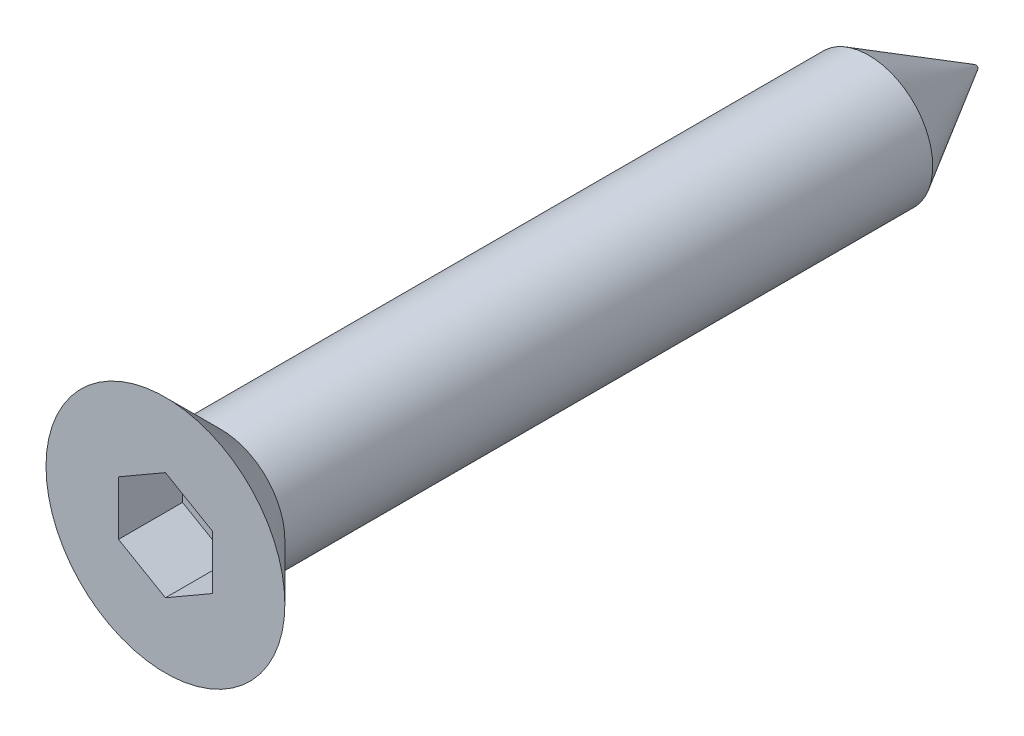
ISO-10303-21;
HEADER;
FILE_DESCRIPTION(('STEP AP214'),'2;1');
FILE_NAME('part.step','',(''),(''),'','','');
FILE_SCHEMA(('AUTOMOTIVE_DESIGN { 1 0 10303 214 1 1 1 1 }'));
ENDSEC;
DATA;
#1=APPLICATION_CONTEXT('core data for automotive mechanical design processes');
#2=APPLICATION_PROTOCOL_DEFINITION('international standard','automotive_design',2000,#1);
#3=PRODUCT_CONTEXT('',#1,'mechanical');
#4=PRODUCT('Part','Part','',(#3));
#5=PRODUCT_RELATED_PRODUCT_CATEGORY('part','',(#4));
#6=PRODUCT_DEFINITION_FORMATION('','',#4);
#7=PRODUCT_DEFINITION_CONTEXT('part definition',#1,'design');
#8=PRODUCT_DEFINITION('design','',#6,#7);
#9=PRODUCT_DEFINITION_SHAPE('','',#8);
#10=(LENGTH_UNIT() NAMED_UNIT(*) SI_UNIT(.MILLI.,.METRE.));
#11=(NAMED_UNIT(*) PLANE_ANGLE_UNIT() SI_UNIT($,.RADIAN.));
#12=(NAMED_UNIT(*) SI_UNIT($,.STERADIAN.) SOLID_ANGLE_UNIT());
#13=UNCERTAINTY_MEASURE_WITH_UNIT(LENGTH_MEASURE(1.E-05),#10,'distance_accuracy_value','');
#14=(GEOMETRIC_REPRESENTATION_CONTEXT(3) GLOBAL_UNCERTAINTY_ASSIGNED_CONTEXT((#13)) GLOBAL_UNIT_ASSIGNED_CONTEXT((#10,
#11,#12)) REPRESENTATION_CONTEXT('',''));
#15=CARTESIAN_POINT('',(0.,0.,0.));
#16=DIRECTION('',(0.,0.,1.));
#17=DIRECTION('',(1.,0.,0.));
#18=AXIS2_PLACEMENT_3D('',#15,#16,#17);
#19=CARTESIAN_POINT('',(0.,2.8,0.));
#20=DIRECTION('',(0.,0.,-1.));
#21=DIRECTION('',(-1.,0.,0.));
#22=AXIS2_PLACEMENT_3D('',#19,#20,#21);
#23=PLANE('',#22);
#24=DIRECTION('',(-0.866025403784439,-0.5,0.));
#25=VECTOR('',#24,1.);
#26=CARTESIAN_POINT('',(0.,1.27017059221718,0.));
#27=LINE('',#26,#25);
#28=CARTESIAN_POINT('',(0.,1.27017059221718,0.));
#29=VERTEX_POINT('',#28);
#30=CARTESIAN_POINT('',(-1.1,0.635085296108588,0.));
#31=VERTEX_POINT('',#30);
#32=EDGE_CURVE('E121',#29,#31,#27,.T.);
#33=ORIENTED_EDGE('',*,*,#32,.F.);
#34=DIRECTION('',(-0.866025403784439,0.5,0.));
#35=VECTOR('',#34,1.);
#36=CARTESIAN_POINT('',(1.1,0.635085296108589,0.));
#37=LINE('',#36,#35);
#38=CARTESIAN_POINT('',(1.1,0.635085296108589,0.));
#39=VERTEX_POINT('',#38);
#40=EDGE_CURVE('E47',#39,#29,#37,.T.);
#41=ORIENTED_EDGE('',*,*,#40,.F.);
#42=DIRECTION('',(0.,1.,0.));
#43=VECTOR('',#42,1.);
#44=CARTESIAN_POINT('',(1.1,-0.635085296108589,0.));
#45=LINE('',#44,#43);
#46=CARTESIAN_POINT('',(1.1,-0.635085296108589,0.));
#47=VERTEX_POINT('',#46);
#48=EDGE_CURVE('E130',#47,#39,#45,.T.);
#49=ORIENTED_EDGE('',*,*,#48,.F.);
#50=DIRECTION('',(0.866025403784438,0.5,0.));
#51=VECTOR('',#50,1.);
#52=CARTESIAN_POINT('',(0.,-1.27017059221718,0.));
#53=LINE('',#52,#51);
#54=CARTESIAN_POINT('',(0.,-1.27017059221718,0.));
#55=VERTEX_POINT('',#54);
#56=EDGE_CURVE('E128',#55,#47,#53,.T.);
#57=ORIENTED_EDGE('',*,*,#56,.F.);
#58=DIRECTION('',(0.866025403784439,-0.5,0.));
#59=VECTOR('',#58,1.);
#60=CARTESIAN_POINT('',(-1.1,-0.635085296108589,0.));
#61=LINE('',#60,#59);
#62=CARTESIAN_POINT('',(-1.1,-0.635085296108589,0.));
#63=VERTEX_POINT('',#62);
#64=EDGE_CURVE('E95',#63,#55,#61,.T.);
#65=ORIENTED_EDGE('',*,*,#64,.F.);
#66=DIRECTION('',(0.,-1.,0.));
#67=VECTOR('',#66,1.);
#68=CARTESIAN_POINT('',(-1.1,0.635085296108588,0.));
#69=LINE('',#68,#67);
#70=EDGE_CURVE('E124',#31,#63,#69,.T.);
#71=ORIENTED_EDGE('',*,*,#70,.F.);
#72=EDGE_LOOP('',(#33,#41,#49,#57,#65,#71));
#73=FACE_BOUND('',#72,.T.);
#74=CARTESIAN_POINT('',(0.,0.,0.));
#75=DIRECTION('',(0.,0.,1.));
#76=DIRECTION('',(1.,0.,0.));
#77=AXIS2_PLACEMENT_3D('',#74,#75,#76);
#78=CIRCLE('',#77,2.8);
#79=CARTESIAN_POINT('',(2.8,0.,0.));
#80=VERTEX_POINT('',#79);
#81=EDGE_CURVE('E142',#80,#80,#78,.T.);
#82=ORIENTED_EDGE('',*,*,#81,.T.);
#83=EDGE_LOOP('',(#82));
#84=FACE_BOUND('',#83,.T.);
#85=ADVANCED_FACE('F32',(#73,#84),#23,.F.);
#86=CARTESIAN_POINT('',(0.,0.,-1.3));
#87=DIRECTION('',(0.,0.,1.));
#88=DIRECTION('',(1.,0.,0.));
#89=AXIS2_PLACEMENT_3D('',#86,#87,#88);
#90=CONICAL_SURFACE('',#89,1.5,0.78539816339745);
#91=ORIENTED_EDGE('',*,*,#81,.F.);
#92=EDGE_LOOP('',(#91));
#93=FACE_BOUND('',#92,.T.);
#94=CARTESIAN_POINT('',(0.,0.,-1.3));
#95=DIRECTION('',(0.,0.,1.));
#96=DIRECTION('',(1.,0.,0.));
#97=AXIS2_PLACEMENT_3D('',#94,#95,#96);
#98=CIRCLE('',#97,1.5);
#99=CARTESIAN_POINT('',(1.5,0.,-1.3));
#100=VERTEX_POINT('',#99);
#101=EDGE_CURVE('E134',#100,#100,#98,.T.);
#102=ORIENTED_EDGE('',*,*,#101,.T.);
#103=EDGE_LOOP('',(#102));
#104=FACE_BOUND('',#103,.T.);
#105=ADVANCED_FACE('F159',(#93,#104),#90,.T.);
#106=CARTESIAN_POINT('',(0.,0.,-19.));
#107=DIRECTION('',(0.,0.,1.));
#108=DIRECTION('',(1.,0.,0.));
#109=AXIS2_PLACEMENT_3D('',#106,#107,#108);
#110=CYLINDRICAL_SURFACE('',#109,1.5);
#111=CARTESIAN_POINT('',(0.,0.,-16.4885263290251));
#112=DIRECTION('',(0.,0.,1.));
#113=DIRECTION('',(1.,0.,0.));
#114=AXIS2_PLACEMENT_3D('',#111,#112,#113);
#115=CIRCLE('',#114,1.5);
#116=CARTESIAN_POINT('',(1.5,0.,-16.4885263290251));
#117=VERTEX_POINT('',#116);
#118=EDGE_CURVE('E40',#117,#117,#115,.T.);
#119=ORIENTED_EDGE('',*,*,#118,.T.);
#120=EDGE_LOOP('',(#119));
#121=FACE_BOUND('',#120,.T.);
#122=ORIENTED_EDGE('',*,*,#101,.F.);
#123=EDGE_LOOP('',(#122));
#124=FACE_BOUND('',#123,.T.);
#125=ADVANCED_FACE('F147',(#121,#124),#110,.T.);
#126=CARTESIAN_POINT('',(0.,0.,-19.));
#127=DIRECTION('',(0.,0.,1.));
#128=DIRECTION('',(1.,0.,0.));
#129=AXIS2_PLACEMENT_3D('',#126,#127,#128);
#130=PLANE('',#129);
#131=CARTESIAN_POINT('',(0.,0.,-19.));
#132=DIRECTION('',(0.,0.,1.));
#133=DIRECTION('',(1.,0.,0.));
#134=AXIS2_PLACEMENT_3D('',#131,#132,#133);
#135=CIRCLE('',#134,0.0500000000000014);
#136=CARTESIAN_POINT('',(0.0500000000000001,0.,-19.));
#137=VERTEX_POINT('',#136);
#138=EDGE_CURVE('E11',#137,#137,#135,.F.);
#139=ORIENTED_EDGE('',*,*,#138,.T.);
#140=EDGE_LOOP('',(#139));
#141=FACE_BOUND('',#140,.T.);
#142=ADVANCED_FACE('F171',(#141),#130,.F.);
#143=CARTESIAN_POINT('',(1.1,0.635085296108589,-1.5));
#144=DIRECTION('',(0.5,0.866025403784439,0.));
#145=DIRECTION('',(-0.866025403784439,0.5,0.));
#146=AXIS2_PLACEMENT_3D('',#143,#144,#145);
#147=PLANE('',#146);
#148=ORIENTED_EDGE('',*,*,#40,.T.);
#149=DIRECTION('',(0.,0.,1.));
#150=VECTOR('',#149,1.);
#151=CARTESIAN_POINT('',(0.,1.27017059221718,-1.5));
#152=LINE('',#151,#150);
#153=CARTESIAN_POINT('',(0.,1.27017059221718,-1.5));
#154=VERTEX_POINT('',#153);
#155=EDGE_CURVE('E77',#154,#29,#152,.T.);
#156=ORIENTED_EDGE('',*,*,#155,.F.);
#157=DIRECTION('',(-0.866025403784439,0.5,0.));
#158=VECTOR('',#157,1.);
#159=CARTESIAN_POINT('',(1.1,0.635085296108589,-1.5));
#160=LINE('',#159,#158);
#161=CARTESIAN_POINT('',(1.1,0.635085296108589,-1.5));
#162=VERTEX_POINT('',#161);
#163=EDGE_CURVE('E132',#162,#154,#160,.T.);
#164=ORIENTED_EDGE('',*,*,#163,.F.);
#165=DIRECTION('',(0.,0.,1.));
#166=VECTOR('',#165,1.);
#167=CARTESIAN_POINT('',(1.1,0.635085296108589,-1.5));
#168=LINE('',#167,#166);
#169=EDGE_CURVE('E55',#162,#39,#168,.T.);
#170=ORIENTED_EDGE('',*,*,#169,.T.);
#171=EDGE_LOOP('',(#148,#156,#164,#170));
#172=FACE_BOUND('',#171,.T.);
#173=ADVANCED_FACE('F174',(#172),#147,.F.);
#174=CARTESIAN_POINT('',(1.1,-0.635085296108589,-1.5));
#175=DIRECTION('',(1.,0.,0.));
#176=DIRECTION('',(0.,1.,0.));
#177=AXIS2_PLACEMENT_3D('',#174,#175,#176);
#178=PLANE('',#177);
#179=ORIENTED_EDGE('',*,*,#48,.T.);
#180=ORIENTED_EDGE('',*,*,#169,.F.);
#181=DIRECTION('',(0.,1.,0.));
#182=VECTOR('',#181,1.);
#183=CARTESIAN_POINT('',(1.1,-0.635085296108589,-1.5));
#184=LINE('',#183,#182);
#185=CARTESIAN_POINT('',(1.1,-0.635085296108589,-1.5));
#186=VERTEX_POINT('',#185);
#187=EDGE_CURVE('E107',#186,#162,#184,.T.);
#188=ORIENTED_EDGE('',*,*,#187,.F.);
#189=DIRECTION('',(0.,0.,1.));
#190=VECTOR('',#189,1.);
#191=CARTESIAN_POINT('',(1.1,-0.635085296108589,-1.5));
#192=LINE('',#191,#190);
#193=EDGE_CURVE('E99',#186,#47,#192,.T.);
#194=ORIENTED_EDGE('',*,*,#193,.T.);
#195=EDGE_LOOP('',(#179,#180,#188,#194));
#196=FACE_BOUND('',#195,.T.);
#197=ADVANCED_FACE('F178',(#196),#178,.F.);
#198=CARTESIAN_POINT('',(0.,-1.27017059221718,-1.5));
#199=DIRECTION('',(0.5,-0.866025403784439,0.));
#200=DIRECTION('',(0.866025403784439,0.5,0.));
#201=AXIS2_PLACEMENT_3D('',#198,#199,#200);
#202=PLANE('',#201);
#203=ORIENTED_EDGE('',*,*,#56,.T.);
#204=ORIENTED_EDGE('',*,*,#193,.F.);
#205=DIRECTION('',(0.866025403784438,0.5,0.));
#206=VECTOR('',#205,1.);
#207=CARTESIAN_POINT('',(0.,-1.27017059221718,-1.5));
#208=LINE('',#207,#206);
#209=CARTESIAN_POINT('',(0.,-1.27017059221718,-1.5));
#210=VERTEX_POINT('',#209);
#211=EDGE_CURVE('E103',#210,#186,#208,.T.);
#212=ORIENTED_EDGE('',*,*,#211,.F.);
#213=DIRECTION('',(0.,0.,1.));
#214=VECTOR('',#213,1.);
#215=CARTESIAN_POINT('',(0.,-1.27017059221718,-1.5));
#216=LINE('',#215,#214);
#217=EDGE_CURVE('E88',#210,#55,#216,.T.);
#218=ORIENTED_EDGE('',*,*,#217,.T.);
#219=EDGE_LOOP('',(#203,#204,#212,#218));
#220=FACE_BOUND('',#219,.T.);
#221=ADVANCED_FACE('F104',(#220),#202,.F.);
#222=CARTESIAN_POINT('',(-1.1,-0.635085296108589,-1.5));
#223=DIRECTION('',(-0.5,-0.866025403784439,0.));
#224=DIRECTION('',(0.866025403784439,-0.5,0.));
#225=AXIS2_PLACEMENT_3D('',#222,#223,#224);
#226=PLANE('',#225);
#227=ORIENTED_EDGE('',*,*,#64,.T.);
#228=ORIENTED_EDGE('',*,*,#217,.F.);
#229=DIRECTION('',(0.866025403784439,-0.5,0.));
#230=VECTOR('',#229,1.);
#231=CARTESIAN_POINT('',(-1.1,-0.635085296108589,-1.5));
#232=LINE('',#231,#230);
#233=CARTESIAN_POINT('',(-1.1,-0.635085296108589,-1.5));
#234=VERTEX_POINT('',#233);
#235=EDGE_CURVE('E92',#234,#210,#232,.T.);
#236=ORIENTED_EDGE('',*,*,#235,.F.);
#237=DIRECTION('',(0.,0.,1.));
#238=VECTOR('',#237,1.);
#239=CARTESIAN_POINT('',(-1.1,-0.635085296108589,-1.5));
#240=LINE('',#239,#238);
#241=EDGE_CURVE('E100',#234,#63,#240,.T.);
#242=ORIENTED_EDGE('',*,*,#241,.T.);
#243=EDGE_LOOP('',(#227,#228,#236,#242));
#244=FACE_BOUND('',#243,.T.);
#245=ADVANCED_FACE('F90',(#244),#226,.F.);
#246=CARTESIAN_POINT('',(-1.1,0.635085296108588,-1.5));
#247=DIRECTION('',(-1.,0.,0.));
#248=DIRECTION('',(0.,-1.,0.));
#249=AXIS2_PLACEMENT_3D('',#246,#247,#248);
#250=PLANE('',#249);
#251=ORIENTED_EDGE('',*,*,#70,.T.);
#252=ORIENTED_EDGE('',*,*,#241,.F.);
#253=DIRECTION('',(0.,-1.,0.));
#254=VECTOR('',#253,1.);
#255=CARTESIAN_POINT('',(-1.1,0.635085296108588,-1.5));
#256=LINE('',#255,#254);
#257=CARTESIAN_POINT('',(-1.1,0.635085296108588,-1.5));
#258=VERTEX_POINT('',#257);
#259=EDGE_CURVE('E113',#258,#234,#256,.T.);
#260=ORIENTED_EDGE('',*,*,#259,.F.);
#261=DIRECTION('',(0.,0.,1.));
#262=VECTOR('',#261,1.);
#263=CARTESIAN_POINT('',(-1.1,0.635085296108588,-1.5));
#264=LINE('',#263,#262);
#265=EDGE_CURVE('E137',#258,#31,#264,.T.);
#266=ORIENTED_EDGE('',*,*,#265,.T.);
#267=EDGE_LOOP('',(#251,#252,#260,#266));
#268=FACE_BOUND('',#267,.T.);
#269=ADVANCED_FACE('F181',(#268),#250,.F.);
#270=CARTESIAN_POINT('',(0.,1.27017059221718,-1.5));
#271=DIRECTION('',(-0.5,0.866025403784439,0.));
#272=DIRECTION('',(-0.866025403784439,-0.5,0.));
#273=AXIS2_PLACEMENT_3D('',#270,#271,#272);
#274=PLANE('',#273);
#275=ORIENTED_EDGE('',*,*,#32,.T.);
#276=ORIENTED_EDGE('',*,*,#265,.F.);
#277=DIRECTION('',(-0.866025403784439,-0.5,0.));
#278=VECTOR('',#277,1.);
#279=CARTESIAN_POINT('',(0.,1.27017059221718,-1.5));
#280=LINE('',#279,#278);
#281=EDGE_CURVE('E115',#154,#258,#280,.T.);
#282=ORIENTED_EDGE('',*,*,#281,.F.);
#283=ORIENTED_EDGE('',*,*,#155,.T.);
#284=EDGE_LOOP('',(#275,#276,#282,#283));
#285=FACE_BOUND('',#284,.T.);
#286=ADVANCED_FACE('F155',(#285),#274,.F.);
#287=CARTESIAN_POINT('',(-1.1,1.90525588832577,-1.5));
#288=DIRECTION('',(0.,0.,1.));
#289=DIRECTION('',(1.,0.,0.));
#290=AXIS2_PLACEMENT_3D('',#287,#288,#289);
#291=PLANE('',#290);
#292=ORIENTED_EDGE('',*,*,#163,.T.);
#293=ORIENTED_EDGE('',*,*,#281,.T.);
#294=ORIENTED_EDGE('',*,*,#259,.T.);
#295=ORIENTED_EDGE('',*,*,#235,.T.);
#296=ORIENTED_EDGE('',*,*,#211,.T.);
#297=ORIENTED_EDGE('',*,*,#187,.T.);
#298=EDGE_LOOP('',(#292,#293,#294,#295,#296,#297));
#299=FACE_BOUND('',#298,.T.);
#300=ADVANCED_FACE('F110',(#299),#291,.T.);
#301=CARTESIAN_POINT('',(0.,0.,-16.4885263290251));
#302=DIRECTION('',(0.,0.,1.));
#303=DIRECTION('',(1.,0.,0.));
#304=AXIS2_PLACEMENT_3D('',#301,#302,#303);
#305=CONICAL_SURFACE('',#304,1.5,0.523598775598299);
#306=CARTESIAN_POINT('',(0.0500000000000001,0.,-19.));
#307=CARTESIAN_POINT('',(0.0651041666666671,0.,-18.9738388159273));
#308=CARTESIAN_POINT('',(0.0802083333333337,0.,-18.9476776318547));
#309=CARTESIAN_POINT('',(0.110416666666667,0.,-18.8953552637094));
#310=CARTESIAN_POINT('',(0.125520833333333,0.,-18.8691940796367));
#311=CARTESIAN_POINT('',(0.155729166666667,0.,-18.8168717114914));
#312=CARTESIAN_POINT('',(0.170833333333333,0.,-18.7907105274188));
#313=CARTESIAN_POINT('',(0.201041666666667,0.,-18.7383881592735));
#314=CARTESIAN_POINT('',(0.216145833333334,0.,-18.7122269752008));
#315=CARTESIAN_POINT('',(0.246354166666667,0.,-18.6599046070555));
#316=CARTESIAN_POINT('',(0.261458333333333,0.,-18.6337434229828));
#317=CARTESIAN_POINT('',(0.291666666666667,0.,-18.5814210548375));
#318=CARTESIAN_POINT('',(0.306770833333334,0.,-18.5552598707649));
#319=CARTESIAN_POINT('',(0.336979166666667,0.,-18.5029375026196));
#320=CARTESIAN_POINT('',(0.352083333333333,0.,-18.4767763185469));
#321=CARTESIAN_POINT('',(0.382291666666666,0.,-18.4244539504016));
#322=CARTESIAN_POINT('',(0.397395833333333,0.,-18.3982927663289));
#323=CARTESIAN_POINT('',(0.427604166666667,0.,-18.3459703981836));
#324=CARTESIAN_POINT('',(0.442708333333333,0.,-18.319809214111));
#325=CARTESIAN_POINT('',(0.472916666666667,0.,-18.2674868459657));
#326=CARTESIAN_POINT('',(0.488020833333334,0.,-18.241325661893));
#327=CARTESIAN_POINT('',(0.518229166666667,0.,-18.1890032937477));
#328=CARTESIAN_POINT('',(0.533333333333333,0.,-18.162842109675));
#329=CARTESIAN_POINT('',(0.563541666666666,0.,-18.1105197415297));
#330=CARTESIAN_POINT('',(0.578645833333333,0.,-18.0843585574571));
#331=CARTESIAN_POINT('',(0.608854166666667,0.,-18.0320361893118));
#332=CARTESIAN_POINT('',(0.623958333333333,0.,-18.0058750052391));
#333=CARTESIAN_POINT('',(0.654166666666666,0.,-17.9535526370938));
#334=CARTESIAN_POINT('',(0.669270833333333,0.,-17.9273914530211));
#335=CARTESIAN_POINT('',(0.699479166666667,0.,-17.8750690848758));
#336=CARTESIAN_POINT('',(0.714583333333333,0.,-17.8489079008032));
#337=CARTESIAN_POINT('',(0.744791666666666,0.,-17.7965855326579));
#338=CARTESIAN_POINT('',(0.759895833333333,0.,-17.7704243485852));
#339=CARTESIAN_POINT('',(0.790104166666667,0.,-17.7181019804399));
#340=CARTESIAN_POINT('',(0.805208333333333,0.,-17.6919407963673));
#341=CARTESIAN_POINT('',(0.835416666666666,0.,-17.6396184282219));
#342=CARTESIAN_POINT('',(0.850520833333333,0.,-17.6134572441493));
#343=CARTESIAN_POINT('',(0.880729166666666,0.,-17.561134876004));
#344=CARTESIAN_POINT('',(0.895833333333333,0.,-17.5349736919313));
#345=CARTESIAN_POINT('',(0.926041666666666,0.,-17.482651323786));
#346=CARTESIAN_POINT('',(0.941145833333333,0.,-17.4564901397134));
#347=CARTESIAN_POINT('',(0.971354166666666,0.,-17.4041677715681));
#348=CARTESIAN_POINT('',(0.986458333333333,0.,-17.3780065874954));
#349=CARTESIAN_POINT('',(1.01666666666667,0.,-17.3256842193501));
#350=CARTESIAN_POINT('',(1.03177083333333,0.,-17.2995230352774));
#351=CARTESIAN_POINT('',(1.06197916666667,0.,-17.2472006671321));
#352=CARTESIAN_POINT('',(1.07708333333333,0.,-17.2210394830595));
#353=CARTESIAN_POINT('',(1.10729166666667,0.,-17.1687171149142));
#354=CARTESIAN_POINT('',(1.12239583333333,0.,-17.1425559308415));
#355=CARTESIAN_POINT('',(1.15260416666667,0.,-17.0902335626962));
#356=CARTESIAN_POINT('',(1.16770833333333,0.,-17.0640723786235));
#357=CARTESIAN_POINT('',(1.19791666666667,0.,-17.0117500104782));
#358=CARTESIAN_POINT('',(1.21302083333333,0.,-16.9855888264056));
#359=CARTESIAN_POINT('',(1.24322916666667,0.,-16.9332664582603));
#360=CARTESIAN_POINT('',(1.25833333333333,0.,-16.9071052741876));
#361=CARTESIAN_POINT('',(1.28854166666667,0.,-16.8547829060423));
#362=CARTESIAN_POINT('',(1.30364583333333,0.,-16.8286217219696));
#363=CARTESIAN_POINT('',(1.33385416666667,0.,-16.7762993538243));
#364=CARTESIAN_POINT('',(1.34895833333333,0.,-16.7501381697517));
#365=CARTESIAN_POINT('',(1.37916666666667,0.,-16.6978158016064));
#366=CARTESIAN_POINT('',(1.39427083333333,0.,-16.6716546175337));
#367=CARTESIAN_POINT('',(1.42447916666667,0.,-16.6193322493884));
#368=CARTESIAN_POINT('',(1.43958333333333,0.,-16.5931710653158));
#369=CARTESIAN_POINT('',(1.46979166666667,0.,-16.5408486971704));
#370=CARTESIAN_POINT('',(1.48489583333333,0.,-16.5146875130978));
#371=CARTESIAN_POINT('',(1.5,0.,-16.4885263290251));
#372=B_SPLINE_CURVE_WITH_KNOTS('',3,(#306,#307,#308,#309,#310,#311,#312,#313,#314,#315,#316,
#317,#318,#319,#320,#321,#322,#323,#324,#325,#326,#327,#328,#329,#330,#331,#332,#333,#334,#335,
#336,#337,#338,#339,#340,#341,#342,#343,#344,#345,#346,#347,#348,#349,#350,#351,#352,#353,#354,
#355,#356,#357,#358,#359,#360,#361,#362,#363,#364,#365,#366,#367,#368,#369,#370,#371),
.UNSPECIFIED.,.F.,.F.,(4,2,2,2,2,2,2,2,2,2,2,2,2,2,2,2,2,2,2,2,2,2,2,2,2,2,2,2,2,2,2,2,4),(0.,
0.0906250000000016,0.181250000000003,0.271875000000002,0.3625,0.453125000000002,0.54375,
0.634375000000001,0.725,0.815625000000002,0.90625,0.996875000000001,1.0875,1.178125,1.26875,
1.359375,1.45,1.540625,1.63125,1.721875,1.8125,1.903125,1.99375,2.084375,2.175,2.265625,2.35625,
2.446875,2.5375,2.628125,2.71875,2.809375,2.9),.UNSPECIFIED.);
#373=EDGE_CURVE('BSEAM34',#137,#117,#372,.T.);
#374=ORIENTED_EDGE('',*,*,#138,.F.);
#375=ORIENTED_EDGE('',*,*,#118,.F.);
#376=ORIENTED_EDGE('',*,*,#373,.T.);
#377=ORIENTED_EDGE('',*,*,#373,.F.);
#378=EDGE_LOOP('',(#374,#376,#375,#377));
#379=FACE_BOUND('',#378,.T.);
#380=ADVANCED_FACE('F34',(#379),#305,.T.);
#381=CLOSED_SHELL('',(#85,#105,#125,#142,#173,#197,#221,#245,#269,#286,#300,#380));
#382=MANIFOLD_SOLID_BREP('B2',#381);
#383=ADVANCED_BREP_SHAPE_REPRESENTATION('',(#18,#382),#14);
#384=SHAPE_DEFINITION_REPRESENTATION(#9,#383);
ENDSEC;
END-ISO-10303-21;
